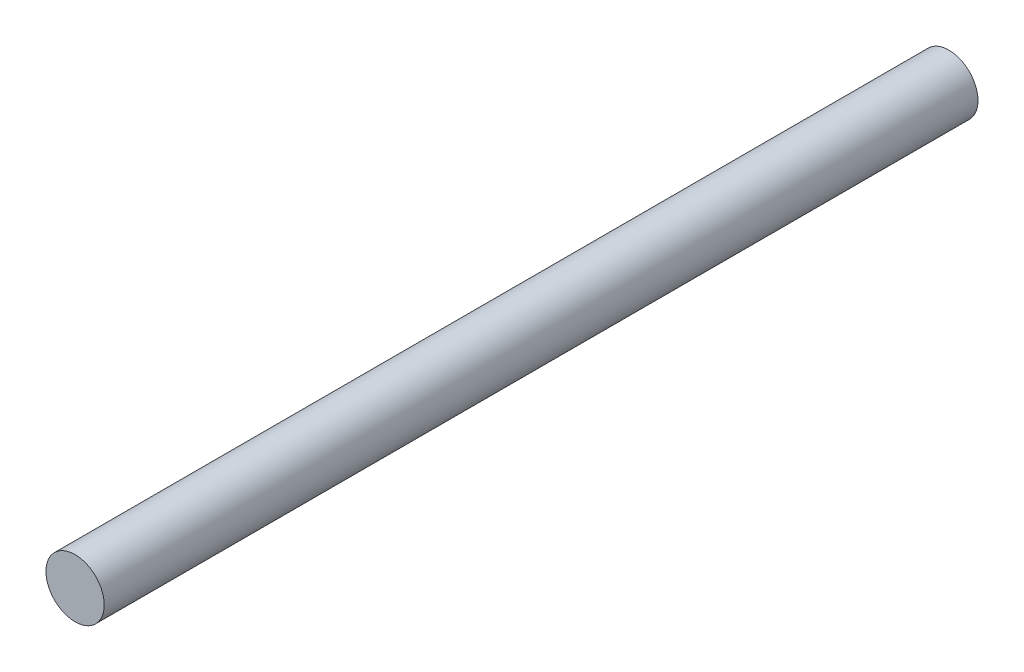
from build123d import *

# Parameters (mm, degrees)
SKETCH1_R           = 10
BOSS_EXTRUDE1_DEPTH = 150


with BuildPart() as part:
    # Sketch1 → Boss-Extrude1 (new, symmetric)
    with BuildSketch(Plane.XY):
        Circle(SKETCH1_R)
    extrude(amount=BOSS_EXTRUDE1_DEPTH, both=True)


solid = part.part
